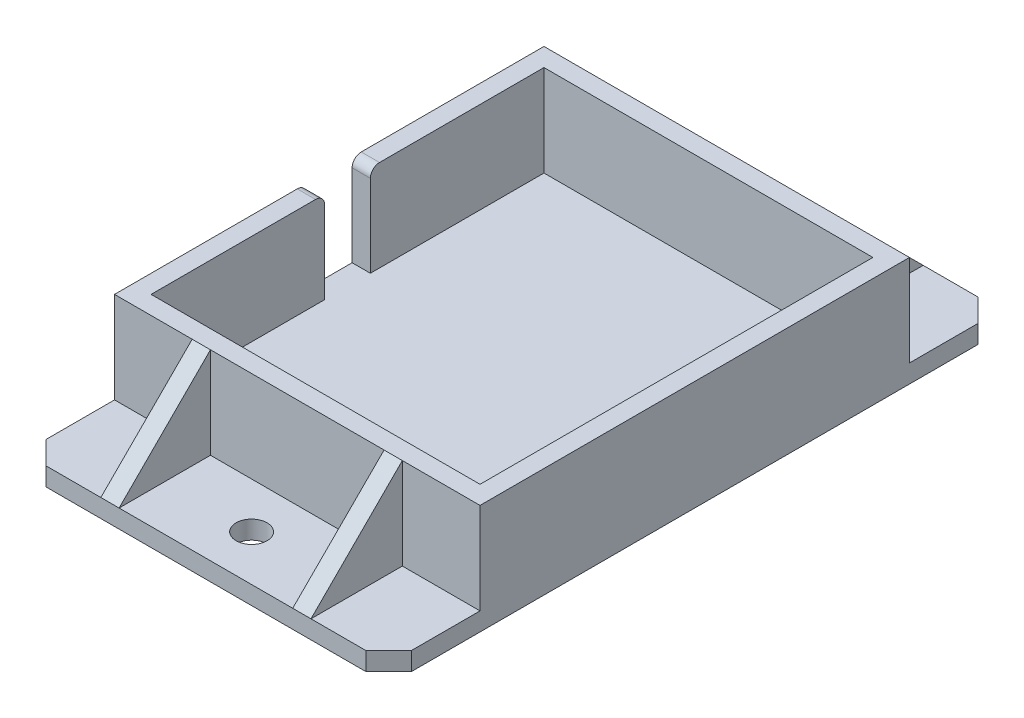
from build123d import *

# Parameters (mm, degrees)
SKETCH1_W               = 80
SKETCH1_H               = 94
SKETCH1_W_2             = 72
SKETCH1_H_2             = 86
BOSS_EXTRUDE3_DEPTH     = 20
SKETCH10_W              = 80
SKETCH10_H              = 134
BOSS_EXTRUDE4_DEPTH     = 4
CUT_EXTRUDE1_REACH      = 108.25
SKETCH11_W              = 10
SKETCH11_H              = 20
FILLET2_R               = 2
TAP_DRILL_FOR_M8_TAP2_D = 6.8
RIB10_REACH             = 94.79
SKETCH26_WALL_W         = 215.864442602
SKETCH26_WALL_H         = 4
MIRROR4_COPY_1_REACH    = 94.79
MIRROR4_COPY_1_SKETCH_W = 215.864442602
MIRROR4_COPY_1_SKETCH_H = 4
CHAMFER1_SIZE           = 5


with BuildPart() as part:
    # Sketch1 → Boss-Extrude3 (new body)
    with BuildSketch(Plane(origin=(0, 0, 0), x_dir=(1, 0, 0), z_dir=(0, 1, 0))):
        Rectangle(SKETCH1_W, SKETCH1_H)
        Rectangle(SKETCH1_W_2, SKETCH1_H_2, mode=Mode.SUBTRACT)
    extrude(amount=BOSS_EXTRUDE3_DEPTH)

    # Sketch10 → Boss-Extrude4 (add)
    with BuildSketch(Plane.XZ):
        Rectangle(SKETCH10_W, SKETCH10_H)
    extrude(amount=BOSS_EXTRUDE4_DEPTH)

    # Sketch11 → Cut-Extrude1 (cut, up to next)
    with BuildSketch(Plane.ZY.offset(40), mode=Mode.PRIVATE) as cut_extrude1_sk1:
        with Locations((0, 10)):
            Rectangle(SKETCH11_W, SKETCH11_H)
    cut_extrude1_tool1 = extrude(cut_extrude1_sk1.sketch, amount=-CUT_EXTRUDE1_REACH, mode=Mode.PRIVATE) & part.part
    add(cut_extrude1_tool1.solids().sort_by_distance((-40, 10, 0))[0], mode=Mode.SUBTRACT)

    # Fillet2
    fillet2_edges = [part.edges().sort_by_distance(p)[0] for p in [
        (-38, 20, 5),
        (-38, 20, -5),
    ]]
    fillet(fillet2_edges, radius=FILLET2_R)

    # Tap Drill for M8 Tap2 (through all)
    with Locations(Plane(origin=(0, 0, 57), x_dir=(0, 0, 1), z_dir=(0, 1, 0))):
        with Locations((0, 0), (-114, 0)):
            Hole(TAP_DRILL_FOR_M8_TAP2_D / 2)

    # Sketch26 wall → Rib10 (add, up to next)
    with BuildSketch(Plane(origin=(-21, 10, -57), x_dir=(0, 0.707106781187, 0.707106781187), z_dir=(0, 0.707106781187, -0.707106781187)), mode=Mode.PRIVATE) as rib10_sk1:
        Rectangle(SKETCH26_WALL_W, SKETCH26_WALL_H)
    rib10_tool1 = extrude(rib10_sk1.sketch, amount=-RIB10_REACH, mode=Mode.PRIVATE) - part.part
    rib10 = rib10_tool1.solids().sort_by_distance((-21, 10, -57))[0]
    add(rib10)

    # Mirror3: Rib10 across plane
    add(rib10.mirror(Plane(origin=(0, 0, 0), x_dir=(0, 0, 1), z_dir=(1, 0, 0))))

    # Mirror4: Rib10 across plane
    add(rib10.mirror(Plane.XY))

    # Mirror4 copy 1 sketch → Mirror4 copy 1 (add, up to next)
    with BuildSketch(Plane(origin=(21, 10, 57), x_dir=(0, 0.707106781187, -0.707106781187), z_dir=(0, 0.707106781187, 0.707106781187)), mode=Mode.PRIVATE) as mirror4_copy_1_sk1:
        Rectangle(MIRROR4_COPY_1_SKETCH_W, MIRROR4_COPY_1_SKETCH_H)
    mirror4_copy_1_tool1 = extrude(mirror4_copy_1_sk1.sketch, amount=-MIRROR4_COPY_1_REACH, mode=Mode.PRIVATE) - part.part
    add(mirror4_copy_1_tool1.solids().sort_by_distance((21, 10, 57))[0])

    # Chamfer1
    chamfer1_edges = [part.edges().sort_by_distance(p)[0] for p in [
        (40, -2, -67),
        (40, -2, 67),
        (-40, -2, 67),
        (-40, -2, -67),
    ]]
    chamfer(chamfer1_edges, length=CHAMFER1_SIZE)


solid = part.part
